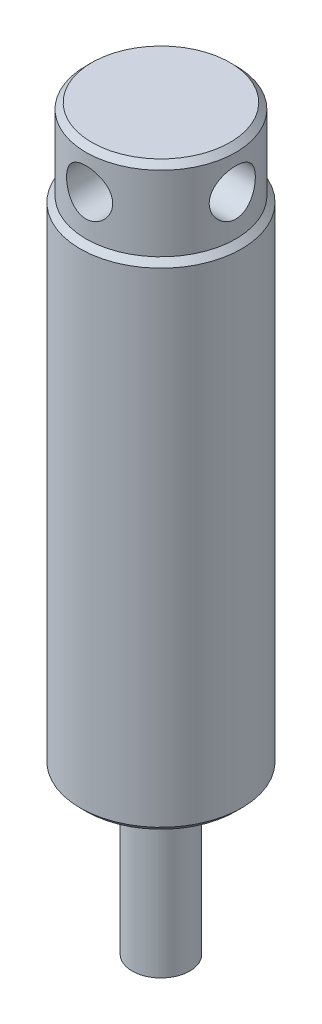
ISO-10303-21;
HEADER;
FILE_DESCRIPTION(('STEP AP214'),'2;1');
FILE_NAME('part.step','',(''),(''),'','','');
FILE_SCHEMA(('AUTOMOTIVE_DESIGN { 1 0 10303 214 1 1 1 1 }'));
ENDSEC;
DATA;
#1=APPLICATION_CONTEXT('core data for automotive mechanical design processes');
#2=APPLICATION_PROTOCOL_DEFINITION('international standard','automotive_design',2000,#1);
#3=PRODUCT_CONTEXT('',#1,'mechanical');
#4=PRODUCT('Part','Part','',(#3));
#5=PRODUCT_RELATED_PRODUCT_CATEGORY('part','',(#4));
#6=PRODUCT_DEFINITION_FORMATION('','',#4);
#7=PRODUCT_DEFINITION_CONTEXT('part definition',#1,'design');
#8=PRODUCT_DEFINITION('design','',#6,#7);
#9=PRODUCT_DEFINITION_SHAPE('','',#8);
#10=(LENGTH_UNIT() NAMED_UNIT(*) SI_UNIT(.MILLI.,.METRE.));
#11=(NAMED_UNIT(*) PLANE_ANGLE_UNIT() SI_UNIT($,.RADIAN.));
#12=(NAMED_UNIT(*) SI_UNIT($,.STERADIAN.) SOLID_ANGLE_UNIT());
#13=UNCERTAINTY_MEASURE_WITH_UNIT(LENGTH_MEASURE(1.E-05),#10,'distance_accuracy_value','');
#14=(GEOMETRIC_REPRESENTATION_CONTEXT(3) GLOBAL_UNCERTAINTY_ASSIGNED_CONTEXT((#13)) GLOBAL_UNIT_ASSIGNED_CONTEXT((#10,
#11,#12)) REPRESENTATION_CONTEXT('',''));
#15=CARTESIAN_POINT('',(0.,0.,0.));
#16=DIRECTION('',(0.,0.,1.));
#17=DIRECTION('',(1.,0.,0.));
#18=AXIS2_PLACEMENT_3D('',#15,#16,#17);
#19=CARTESIAN_POINT('',(0.,60.5,-8.));
#20=DIRECTION('',(0.,0.,1.));
#21=DIRECTION('',(1.,0.,0.));
#22=AXIS2_PLACEMENT_3D('',#19,#20,#21);
#23=CYLINDRICAL_SURFACE('',#22,2.);
#24=CARTESIAN_POINT('',(2.,60.5,6.18465843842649));
#25=CARTESIAN_POINT('',(1.9999990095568,60.3905521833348,6.18465930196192));
#26=CARTESIAN_POINT('',(1.99098535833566,60.2810945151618,6.18759551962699));
#27=CARTESIAN_POINT('',(1.95526805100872,60.0653888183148,6.19897317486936));
#28=CARTESIAN_POINT('',(1.92855917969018,59.9591417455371,6.2074162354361));
#29=CARTESIAN_POINT('',(1.85845185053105,59.753012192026,6.22876273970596));
#30=CARTESIAN_POINT('',(1.8150822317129,59.6531190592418,6.24165847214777));
#31=CARTESIAN_POINT('',(1.71298018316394,59.4620001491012,6.27044669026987));
#32=CARTESIAN_POINT('',(1.65424519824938,59.3707758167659,6.28633967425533));
#33=CARTESIAN_POINT('',(1.52098542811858,59.196546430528,6.31992519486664));
#34=CARTESIAN_POINT('',(1.44603755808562,59.1138725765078,6.33765756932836));
#35=CARTESIAN_POINT('',(1.2833853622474,58.9620462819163,6.37258438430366));
#36=CARTESIAN_POINT('',(1.19567931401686,58.892895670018,6.38977875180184));
#37=CARTESIAN_POINT('',(1.00762969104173,58.7686263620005,6.4221466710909));
#38=CARTESIAN_POINT('',(0.9070517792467,58.7138474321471,6.43726783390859));
#39=CARTESIAN_POINT('',(0.697566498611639,58.6221110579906,6.46332130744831));
#40=CARTESIAN_POINT('',(0.588661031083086,58.5851495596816,6.47425457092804));
#41=CARTESIAN_POINT('',(0.36907878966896,58.5311992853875,6.49041842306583));
#42=CARTESIAN_POINT('',(0.258553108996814,58.513644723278,6.49581021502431));
#43=CARTESIAN_POINT('',(0.0360024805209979,58.4972153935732,6.50085231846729));
#44=CARTESIAN_POINT('',(-0.0760221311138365,58.4983365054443,6.50050389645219));
#45=CARTESIAN_POINT('',(-0.294413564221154,58.5188515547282,6.49421773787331));
#46=CARTESIAN_POINT('',(-0.400844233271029,58.5376324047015,6.48846753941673));
#47=CARTESIAN_POINT('',(-0.6089625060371,58.5919295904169,6.47225351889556));
#48=CARTESIAN_POINT('',(-0.710649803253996,58.6274470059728,6.46178939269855));
#49=CARTESIAN_POINT('',(-0.907825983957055,58.7146112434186,6.43706860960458));
#50=CARTESIAN_POINT('',(-1.00322571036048,58.7664467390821,6.42276789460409));
#51=CARTESIAN_POINT('',(-1.18416561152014,58.8846251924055,6.39188462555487));
#52=CARTESIAN_POINT('',(-1.26970334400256,58.9509717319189,6.37530150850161));
#53=CARTESIAN_POINT('',(-1.43214818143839,59.0994491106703,6.34083036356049));
#54=CARTESIAN_POINT('',(-1.50856604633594,59.1821099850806,6.32291668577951));
#55=CARTESIAN_POINT('',(-1.64659789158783,59.3592439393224,6.28838540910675));
#56=CARTESIAN_POINT('',(-1.70821023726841,59.4537183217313,6.27176795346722));
#57=CARTESIAN_POINT('',(-1.81542815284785,59.6531430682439,6.24158384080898));
#58=CARTESIAN_POINT('',(-1.86085804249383,59.7581934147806,6.22805120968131));
#59=CARTESIAN_POINT('',(-1.93323233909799,59.9749687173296,6.20596978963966));
#60=CARTESIAN_POINT('',(-1.96018314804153,60.0866913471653,6.19741927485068));
#61=CARTESIAN_POINT('',(-1.99390183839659,60.3089645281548,6.18665163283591));
#62=CARTESIAN_POINT('',(-2.00141677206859,60.4193904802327,6.18420022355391));
#63=CARTESIAN_POINT('',(-1.99814331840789,60.6399313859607,6.18525890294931));
#64=CARTESIAN_POINT('',(-1.98735765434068,60.7500463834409,6.18876810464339));
#65=CARTESIAN_POINT('',(-1.94845591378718,60.9636626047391,6.20112183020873));
#66=CARTESIAN_POINT('',(-1.92082922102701,61.0672625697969,6.2098155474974));
#67=CARTESIAN_POINT('',(-1.84960144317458,61.2683468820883,6.23140033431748));
#68=CARTESIAN_POINT('',(-1.80599780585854,61.3658302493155,6.24429207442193));
#69=CARTESIAN_POINT('',(-1.70266083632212,61.5549309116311,6.27326823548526));
#70=CARTESIAN_POINT('',(-1.642510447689,61.6463078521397,6.28943187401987));
#71=CARTESIAN_POINT('',(-1.50827755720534,61.8179435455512,6.32296420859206));
#72=CARTESIAN_POINT('',(-1.43419154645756,61.8981994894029,6.34033320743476));
#73=CARTESIAN_POINT('',(-1.27066455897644,62.0486245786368,6.37515982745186));
#74=CARTESIAN_POINT('',(-1.18072798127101,62.1182619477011,6.39259321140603));
#75=CARTESIAN_POINT('',(-0.990026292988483,62.2414740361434,6.4248880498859));
#76=CARTESIAN_POINT('',(-0.889261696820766,62.2950495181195,6.43974962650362));
#77=CARTESIAN_POINT('',(-0.680404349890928,62.3841011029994,6.46513895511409));
#78=CARTESIAN_POINT('',(-0.572372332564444,62.4197101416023,6.47569842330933));
#79=CARTESIAN_POINT('',(-0.351472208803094,62.4721417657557,6.49143353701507));
#80=CARTESIAN_POINT('',(-0.238605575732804,62.4889700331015,6.49661081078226));
#81=CARTESIAN_POINT('',(-0.0161425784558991,62.502912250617,6.50089371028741));
#82=CARTESIAN_POINT('',(0.0934015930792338,62.5007954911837,6.50023627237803));
#83=CARTESIAN_POINT('',(0.310503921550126,62.4787598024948,6.49348761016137));
#84=CARTESIAN_POINT('',(0.418062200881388,62.4588419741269,6.48739672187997));
#85=CARTESIAN_POINT('',(0.626896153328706,62.4022541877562,6.47053765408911));
#86=CARTESIAN_POINT('',(0.728231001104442,62.3657847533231,6.45982553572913));
#87=CARTESIAN_POINT('',(0.923394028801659,62.2773093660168,6.43482974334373));
#88=CARTESIAN_POINT('',(1.01722093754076,62.2253007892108,6.4205454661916));
#89=CARTESIAN_POINT('',(1.19809140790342,62.1052252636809,6.38931014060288));
#90=CARTESIAN_POINT('',(1.28480651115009,62.036682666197,6.37228632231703));
#91=CARTESIAN_POINT('',(1.44576009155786,61.8863305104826,6.33770998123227));
#92=CARTESIAN_POINT('',(1.51999487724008,61.8045170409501,6.32015730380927));
#93=CARTESIAN_POINT('',(1.65626040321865,61.626823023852,6.28584951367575));
#94=CARTESIAN_POINT('',(1.71782754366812,61.5305776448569,6.26913756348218));
#95=CARTESIAN_POINT('',(1.82384213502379,61.3286092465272,6.23912274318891));
#96=CARTESIAN_POINT('',(1.86829702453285,61.2228903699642,6.22581839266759));
#97=CARTESIAN_POINT('',(1.93528263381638,61.0152118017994,6.20530356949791));
#98=CARTESIAN_POINT('',(1.95948210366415,60.9138336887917,6.19763764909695));
#99=CARTESIAN_POINT('',(1.99183943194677,60.7083062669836,6.18731524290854));
#100=CARTESIAN_POINT('',(2.00000094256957,60.6041575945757,6.18465761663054));
#101=CARTESIAN_POINT('',(2.,60.5,6.18465843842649));
#102=B_SPLINE_CURVE_WITH_KNOTS('',3,(#24,#25,#26,#27,#28,#29,#30,#31,#32,#33,#34,#35,#36,#37,
#38,#39,#40,#41,#42,#43,#44,#45,#46,#47,#48,#49,#50,#51,#52,#53,#54,#55,#56,#57,#58,#59,#60,#61,
#62,#63,#64,#65,#66,#67,#68,#69,#70,#71,#72,#73,#74,#75,#76,#77,#78,#79,#80,#81,#82,#83,#84,#85,
#86,#87,#88,#89,#90,#91,#92,#93,#94,#95,#96,#97,#98,#99,#100,#101),.UNSPECIFIED.,.T.,.F.,(4,2,2,
2,2,2,2,2,2,2,2,2,2,2,2,2,2,2,2,2,2,2,2,2,2,2,2,2,2,2,2,2,2,2,2,2,2,2,4),(0.,0.327958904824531,
0.656014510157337,0.98350480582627,1.31104959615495,1.64848092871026,1.9859578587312,
2.33081172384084,2.6755870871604,3.0100217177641,3.34438256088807,3.66754797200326,
3.99073423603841,4.31780371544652,4.6449540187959,4.98534121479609,5.32576597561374,
5.66978125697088,6.01367729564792,6.34414407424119,6.67456168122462,6.99580726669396,
7.317104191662,7.6473882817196,7.97775564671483,8.3213356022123,8.664899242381,9.00588210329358,
9.34676177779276,9.67386437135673,10.0009467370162,10.3241681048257,10.6474440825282,
10.9814486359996,11.3155518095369,11.6602881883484,12.0048745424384,12.3170524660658,
12.6291592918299),.UNSPECIFIED.);
#103=CARTESIAN_POINT('',(2.,60.5,6.18465843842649));
#104=VERTEX_POINT('',#103);
#105=EDGE_CURVE('E392',#104,#104,#102,.T.);
#106=ORIENTED_EDGE('',*,*,#105,.F.);
#107=EDGE_LOOP('',(#106));
#108=FACE_BOUND('',#107,.T.);
#109=CARTESIAN_POINT('',(0.,60.5,0.));
#110=DIRECTION('',(-0.707106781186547,0.,0.707106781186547));
#111=DIRECTION('',(0.707106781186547,0.,0.707106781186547));
#112=AXIS2_PLACEMENT_3D('',#109,#110,#111);
#113=ELLIPSE('',#112,2.82842712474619,2.);
#114=CARTESIAN_POINT('',(0.,62.5,0.));
#115=VERTEX_POINT('',#114);
#116=CARTESIAN_POINT('',(0.,58.5,0.));
#117=VERTEX_POINT('',#116);
#118=EDGE_CURVE('E364',#115,#117,#113,.F.);
#119=ORIENTED_EDGE('',*,*,#118,.T.);
#120=CARTESIAN_POINT('',(0.,60.5,0.));
#121=DIRECTION('',(0.707106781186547,0.,0.707106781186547));
#122=DIRECTION('',(-0.707106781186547,0.,0.707106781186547));
#123=AXIS2_PLACEMENT_3D('',#120,#121,#122);
#124=ELLIPSE('',#123,2.82842712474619,2.);
#125=EDGE_CURVE('E11',#117,#115,#124,.F.);
#126=ORIENTED_EDGE('',*,*,#125,.T.);
#127=EDGE_LOOP('',(#119,#126));
#128=FACE_BOUND('',#127,.T.);
#129=ADVANCED_FACE('F351',(#108,#128),#23,.F.);
#130=CARTESIAN_POINT('',(0.,14.,0.));
#131=DIRECTION('',(0.,-1.,0.));
#132=DIRECTION('',(0.,0.,-1.));
#133=AXIS2_PLACEMENT_3D('',#130,#131,#132);
#134=CYLINDRICAL_SURFACE('',#133,2.5);
#135=CARTESIAN_POINT('',(0.,14.,0.));
#136=DIRECTION('',(0.,1.,0.));
#137=DIRECTION('',(0.,0.,1.));
#138=AXIS2_PLACEMENT_3D('',#135,#136,#137);
#139=CIRCLE('',#138,2.5);
#140=CARTESIAN_POINT('',(0.,14.,2.5));
#141=VERTEX_POINT('',#140);
#142=EDGE_CURVE('E454',#141,#141,#139,.T.);
#143=ORIENTED_EDGE('',*,*,#142,.F.);
#144=EDGE_LOOP('',(#143));
#145=FACE_BOUND('',#144,.T.);
#146=CARTESIAN_POINT('',(0.,0.,0.));
#147=DIRECTION('',(0.,1.,0.));
#148=DIRECTION('',(0.,0.,1.));
#149=AXIS2_PLACEMENT_3D('',#146,#147,#148);
#150=CIRCLE('',#149,2.5);
#151=CARTESIAN_POINT('',(0.,0.,2.5));
#152=VERTEX_POINT('',#151);
#153=EDGE_CURVE('E451',#152,#152,#150,.T.);
#154=ORIENTED_EDGE('',*,*,#153,.T.);
#155=EDGE_LOOP('',(#154));
#156=FACE_BOUND('',#155,.T.);
#157=ADVANCED_FACE('F353',(#145,#156),#134,.T.);
#158=CARTESIAN_POINT('',(0.,0.,0.));
#159=DIRECTION('',(0.,1.,0.));
#160=DIRECTION('',(0.,0.,1.));
#161=AXIS2_PLACEMENT_3D('',#158,#159,#160);
#162=PLANE('',#161);
#163=ORIENTED_EDGE('',*,*,#153,.F.);
#164=EDGE_LOOP('',(#163));
#165=FACE_BOUND('',#164,.T.);
#166=ADVANCED_FACE('F432',(#165),#162,.F.);
#167=CARTESIAN_POINT('',(0.,14.,0.));
#168=DIRECTION('',(0.,1.,0.));
#169=DIRECTION('',(0.,0.,1.));
#170=AXIS2_PLACEMENT_3D('',#167,#168,#169);
#171=PLANE('',#170);
#172=CARTESIAN_POINT('',(0.,14.,0.));
#173=DIRECTION('',(0.,1.,0.));
#174=DIRECTION('',(0.,0.,1.));
#175=AXIS2_PLACEMENT_3D('',#172,#173,#174);
#176=CIRCLE('',#175,6.5);
#177=CARTESIAN_POINT('',(0.,14.,6.5));
#178=VERTEX_POINT('',#177);
#179=EDGE_CURVE('E379',#178,#178,#176,.F.);
#180=ORIENTED_EDGE('',*,*,#179,.T.);
#181=EDGE_LOOP('',(#180));
#182=FACE_BOUND('',#181,.T.);
#183=ORIENTED_EDGE('',*,*,#142,.T.);
#184=EDGE_LOOP('',(#183));
#185=FACE_BOUND('',#184,.T.);
#186=ADVANCED_FACE('F470',(#182,#185),#171,.F.);
#187=CARTESIAN_POINT('',(0.,57.,0.));
#188=DIRECTION('',(0.,-1.,0.));
#189=DIRECTION('',(0.,0.,-1.));
#190=AXIS2_PLACEMENT_3D('',#187,#188,#189);
#191=CYLINDRICAL_SURFACE('',#190,7.);
#192=CARTESIAN_POINT('',(0.,56.5,0.));
#193=DIRECTION('',(0.,1.,0.));
#194=DIRECTION('',(0.,0.,1.));
#195=AXIS2_PLACEMENT_3D('',#192,#193,#194);
#196=CIRCLE('',#195,7.);
#197=CARTESIAN_POINT('',(0.,56.5,7.));
#198=VERTEX_POINT('',#197);
#199=EDGE_CURVE('E465',#198,#198,#196,.F.);
#200=ORIENTED_EDGE('',*,*,#199,.T.);
#201=EDGE_LOOP('',(#200));
#202=FACE_BOUND('',#201,.T.);
#203=CARTESIAN_POINT('',(0.,14.5,0.));
#204=DIRECTION('',(0.,1.,0.));
#205=DIRECTION('',(0.,0.,1.));
#206=AXIS2_PLACEMENT_3D('',#203,#204,#205);
#207=CIRCLE('',#206,7.);
#208=CARTESIAN_POINT('',(0.,14.5,7.));
#209=VERTEX_POINT('',#208);
#210=EDGE_CURVE('E462',#209,#209,#207,.T.);
#211=ORIENTED_EDGE('',*,*,#210,.T.);
#212=EDGE_LOOP('',(#211));
#213=FACE_BOUND('',#212,.T.);
#214=ADVANCED_FACE('F424',(#202,#213),#191,.T.);
#215=CARTESIAN_POINT('',(0.,64.,0.));
#216=DIRECTION('',(0.,-1.,0.));
#217=DIRECTION('',(0.,0.,-1.));
#218=AXIS2_PLACEMENT_3D('',#215,#216,#217);
#219=CYLINDRICAL_SURFACE('',#218,6.5);
#220=CARTESIAN_POINT('',(-6.18465843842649,60.5,-2.));
#221=CARTESIAN_POINT('',(-6.18465930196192,60.6094478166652,-1.9999990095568));
#222=CARTESIAN_POINT('',(-6.18759551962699,60.7189054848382,-1.99098535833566));
#223=CARTESIAN_POINT('',(-6.19897317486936,60.9346111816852,-1.95526805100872));
#224=CARTESIAN_POINT('',(-6.2074162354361,61.0408582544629,-1.92855917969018));
#225=CARTESIAN_POINT('',(-6.22876273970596,61.246987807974,-1.85845185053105));
#226=CARTESIAN_POINT('',(-6.24165847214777,61.3468809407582,-1.8150822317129));
#227=CARTESIAN_POINT('',(-6.27044669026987,61.5379998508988,-1.71298018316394));
#228=CARTESIAN_POINT('',(-6.28633967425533,61.6292241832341,-1.65424519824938));
#229=CARTESIAN_POINT('',(-6.31992519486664,61.803453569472,-1.52098542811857));
#230=CARTESIAN_POINT('',(-6.33765756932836,61.8861274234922,-1.44603755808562));
#231=CARTESIAN_POINT('',(-6.37258438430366,62.0379537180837,-1.28338536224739));
#232=CARTESIAN_POINT('',(-6.38977875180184,62.107104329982,-1.19567931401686));
#233=CARTESIAN_POINT('',(-6.4221466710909,62.2313736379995,-1.00762969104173));
#234=CARTESIAN_POINT('',(-6.43726783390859,62.2861525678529,-0.907051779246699));
#235=CARTESIAN_POINT('',(-6.46332130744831,62.3778889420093,-0.697566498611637));
#236=CARTESIAN_POINT('',(-6.47425457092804,62.4148504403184,-0.588661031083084));
#237=CARTESIAN_POINT('',(-6.49041842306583,62.4688007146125,-0.369078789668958));
#238=CARTESIAN_POINT('',(-6.49581021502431,62.486355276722,-0.258553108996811));
#239=CARTESIAN_POINT('',(-6.50085231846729,62.5027846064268,-0.0360024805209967));
#240=CARTESIAN_POINT('',(-6.50050389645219,62.5016634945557,0.076022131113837));
#241=CARTESIAN_POINT('',(-6.49421773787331,62.4811484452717,0.294413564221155));
#242=CARTESIAN_POINT('',(-6.48846753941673,62.4623675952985,0.40084423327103));
#243=CARTESIAN_POINT('',(-6.47225351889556,62.4080704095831,0.608962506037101));
#244=CARTESIAN_POINT('',(-6.46178939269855,62.3725529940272,0.710649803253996));
#245=CARTESIAN_POINT('',(-6.43706860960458,62.2853887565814,0.907825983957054));
#246=CARTESIAN_POINT('',(-6.42276789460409,62.2335532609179,1.00322571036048));
#247=CARTESIAN_POINT('',(-6.39188462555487,62.1153748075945,1.18416561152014));
#248=CARTESIAN_POINT('',(-6.37530150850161,62.0490282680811,1.26970334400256));
#249=CARTESIAN_POINT('',(-6.34083036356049,61.9005508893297,1.43214818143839));
#250=CARTESIAN_POINT('',(-6.32291668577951,61.8178900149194,1.50856604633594));
#251=CARTESIAN_POINT('',(-6.28838540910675,61.6407560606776,1.64659789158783));
#252=CARTESIAN_POINT('',(-6.27176795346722,61.5462816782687,1.70821023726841));
#253=CARTESIAN_POINT('',(-6.24158384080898,61.3468569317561,1.81542815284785));
#254=CARTESIAN_POINT('',(-6.22805120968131,61.2418065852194,1.86085804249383));
#255=CARTESIAN_POINT('',(-6.20596978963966,61.0250312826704,1.93323233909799));
#256=CARTESIAN_POINT('',(-6.19741927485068,60.9133086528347,1.96018314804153));
#257=CARTESIAN_POINT('',(-6.18665163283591,60.6910354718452,1.99390183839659));
#258=CARTESIAN_POINT('',(-6.18420022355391,60.5806095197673,2.00141677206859));
#259=CARTESIAN_POINT('',(-6.18525890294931,60.3600686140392,1.99814331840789));
#260=CARTESIAN_POINT('',(-6.18876810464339,60.2499536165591,1.98735765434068));
#261=CARTESIAN_POINT('',(-6.20112183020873,60.0363373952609,1.94845591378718));
#262=CARTESIAN_POINT('',(-6.20981554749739,59.9327374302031,1.92082922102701));
#263=CARTESIAN_POINT('',(-6.23140033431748,59.7316531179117,1.84960144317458));
#264=CARTESIAN_POINT('',(-6.24429207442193,59.6341697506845,1.80599780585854));
#265=CARTESIAN_POINT('',(-6.27326823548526,59.4450690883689,1.70266083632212));
#266=CARTESIAN_POINT('',(-6.28943187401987,59.3536921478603,1.642510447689));
#267=CARTESIAN_POINT('',(-6.32296420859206,59.1820564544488,1.50827755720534));
#268=CARTESIAN_POINT('',(-6.34033320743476,59.1018005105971,1.43419154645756));
#269=CARTESIAN_POINT('',(-6.37515982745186,58.9513754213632,1.27066455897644));
#270=CARTESIAN_POINT('',(-6.39259321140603,58.8817380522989,1.18072798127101));
#271=CARTESIAN_POINT('',(-6.4248880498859,58.7585259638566,0.990026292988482));
#272=CARTESIAN_POINT('',(-6.43974962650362,58.7049504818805,0.889261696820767));
#273=CARTESIAN_POINT('',(-6.46513895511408,58.6158988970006,0.680404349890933));
#274=CARTESIAN_POINT('',(-6.47569842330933,58.5802898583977,0.572372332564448));
#275=CARTESIAN_POINT('',(-6.49143353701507,58.5278582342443,0.351472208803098));
#276=CARTESIAN_POINT('',(-6.49661081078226,58.5110299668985,0.238605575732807));
#277=CARTESIAN_POINT('',(-6.50089371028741,58.497087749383,0.0161425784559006));
#278=CARTESIAN_POINT('',(-6.50023627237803,58.4992045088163,-0.0934015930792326));
#279=CARTESIAN_POINT('',(-6.49348761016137,58.5212401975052,-0.310503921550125));
#280=CARTESIAN_POINT('',(-6.48739672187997,58.5411580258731,-0.418062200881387));
#281=CARTESIAN_POINT('',(-6.47053765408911,58.5977458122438,-0.626896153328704));
#282=CARTESIAN_POINT('',(-6.45982553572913,58.6342152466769,-0.72823100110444));
#283=CARTESIAN_POINT('',(-6.43482974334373,58.7226906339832,-0.923394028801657));
#284=CARTESIAN_POINT('',(-6.4205454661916,58.7746992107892,-1.01722093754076));
#285=CARTESIAN_POINT('',(-6.38931014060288,58.8947747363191,-1.19809140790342));
#286=CARTESIAN_POINT('',(-6.37228632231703,58.963317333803,-1.28480651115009));
#287=CARTESIAN_POINT('',(-6.33770998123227,59.1136694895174,-1.44576009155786));
#288=CARTESIAN_POINT('',(-6.32015730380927,59.1954829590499,-1.51999487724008));
#289=CARTESIAN_POINT('',(-6.28584951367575,59.3731769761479,-1.65626040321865));
#290=CARTESIAN_POINT('',(-6.26913756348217,59.4694223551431,-1.71782754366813));
#291=CARTESIAN_POINT('',(-6.23912274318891,59.6713907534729,-1.8238421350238));
#292=CARTESIAN_POINT('',(-6.22581839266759,59.7771096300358,-1.86829702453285));
#293=CARTESIAN_POINT('',(-6.20530356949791,59.9847881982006,-1.93528263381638));
#294=CARTESIAN_POINT('',(-6.19763764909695,60.0861663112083,-1.95948210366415));
#295=CARTESIAN_POINT('',(-6.18731524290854,60.2916937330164,-1.99183943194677));
#296=CARTESIAN_POINT('',(-6.18465761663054,60.3958424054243,-2.00000094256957));
#297=CARTESIAN_POINT('',(-6.18465843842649,60.5,-2.));
#298=B_SPLINE_CURVE_WITH_KNOTS('',3,(#220,#221,#222,#223,#224,#225,#226,#227,#228,#229,#230,
#231,#232,#233,#234,#235,#236,#237,#238,#239,#240,#241,#242,#243,#244,#245,#246,#247,#248,#249,
#250,#251,#252,#253,#254,#255,#256,#257,#258,#259,#260,#261,#262,#263,#264,#265,#266,#267,#268,
#269,#270,#271,#272,#273,#274,#275,#276,#277,#278,#279,#280,#281,#282,#283,#284,#285,#286,#287,
#288,#289,#290,#291,#292,#293,#294,#295,#296,#297),.UNSPECIFIED.,.T.,.F.,(4,2,2,2,2,2,2,2,2,2,2,
2,2,2,2,2,2,2,2,2,2,2,2,2,2,2,2,2,2,2,2,2,2,2,2,2,2,2,4),(0.,0.327958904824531,
0.656014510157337,0.98350480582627,1.31104959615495,1.64848092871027,1.9859578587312,
2.33081172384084,2.6755870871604,3.0100217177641,3.34438256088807,3.66754797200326,
3.99073423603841,4.31780371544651,4.6449540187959,4.98534121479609,5.32576597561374,
5.66978125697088,6.01367729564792,6.34414407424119,6.67456168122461,6.99580726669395,
7.31710419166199,7.6473882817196,7.97775564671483,8.3213356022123,8.66489924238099,
9.00588210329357,9.34676177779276,9.67386437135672,10.0009467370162,10.3241681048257,
10.6474440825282,10.9814486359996,11.3155518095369,11.6602881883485,12.0048745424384,
12.3170524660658,12.6291592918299),.UNSPECIFIED.);
#299=CARTESIAN_POINT('',(-6.18465843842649,60.5,-2.));
#300=VERTEX_POINT('',#299);
#301=EDGE_CURVE('E437',#300,#300,#298,.T.);
#302=ORIENTED_EDGE('',*,*,#301,.T.);
#303=EDGE_LOOP('',(#302));
#304=FACE_BOUND('',#303,.T.);
#305=CARTESIAN_POINT('',(6.18465843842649,60.5,-2.));
#306=CARTESIAN_POINT('',(6.18465930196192,60.3905521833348,-1.9999990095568));
#307=CARTESIAN_POINT('',(6.18759551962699,60.2810945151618,-1.99098535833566));
#308=CARTESIAN_POINT('',(6.19897317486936,60.0653888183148,-1.95526805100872));
#309=CARTESIAN_POINT('',(6.2074162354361,59.9591417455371,-1.92855917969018));
#310=CARTESIAN_POINT('',(6.22876273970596,59.753012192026,-1.85845185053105));
#311=CARTESIAN_POINT('',(6.24165847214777,59.6531190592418,-1.8150822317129));
#312=CARTESIAN_POINT('',(6.27044669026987,59.4620001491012,-1.71298018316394));
#313=CARTESIAN_POINT('',(6.28633967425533,59.3707758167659,-1.65424519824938));
#314=CARTESIAN_POINT('',(6.31992519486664,59.196546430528,-1.52098542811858));
#315=CARTESIAN_POINT('',(6.33765756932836,59.1138725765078,-1.44603755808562));
#316=CARTESIAN_POINT('',(6.37258438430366,58.9620462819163,-1.2833853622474));
#317=CARTESIAN_POINT('',(6.38977875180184,58.892895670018,-1.19567931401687));
#318=CARTESIAN_POINT('',(6.4221466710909,58.7686263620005,-1.00762969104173));
#319=CARTESIAN_POINT('',(6.43726783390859,58.7138474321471,-0.9070517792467));
#320=CARTESIAN_POINT('',(6.46332130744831,58.6221110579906,-0.697566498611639));
#321=CARTESIAN_POINT('',(6.47425457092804,58.5851495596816,-0.588661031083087));
#322=CARTESIAN_POINT('',(6.49041842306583,58.5311992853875,-0.369078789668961));
#323=CARTESIAN_POINT('',(6.49581021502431,58.513644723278,-0.258553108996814));
#324=CARTESIAN_POINT('',(6.50085231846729,58.4972153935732,-0.0360024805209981));
#325=CARTESIAN_POINT('',(6.50050389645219,58.4983365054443,0.0760221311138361));
#326=CARTESIAN_POINT('',(6.49421773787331,58.5188515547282,0.294413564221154));
#327=CARTESIAN_POINT('',(6.48846753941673,58.5376324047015,0.40084423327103));
#328=CARTESIAN_POINT('',(6.47225351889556,58.5919295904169,0.6089625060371));
#329=CARTESIAN_POINT('',(6.46178939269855,58.6274470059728,0.710649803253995));
#330=CARTESIAN_POINT('',(6.43706860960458,58.7146112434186,0.907825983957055));
#331=CARTESIAN_POINT('',(6.42276789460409,58.7664467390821,1.00322571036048));
#332=CARTESIAN_POINT('',(6.39188462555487,58.8846251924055,1.18416561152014));
#333=CARTESIAN_POINT('',(6.37530150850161,58.9509717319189,1.26970334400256));
#334=CARTESIAN_POINT('',(6.34083036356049,59.0994491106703,1.43214818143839));
#335=CARTESIAN_POINT('',(6.32291668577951,59.1821099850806,1.50856604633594));
#336=CARTESIAN_POINT('',(6.28838540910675,59.3592439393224,1.64659789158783));
#337=CARTESIAN_POINT('',(6.27176795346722,59.4537183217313,1.70821023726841));
#338=CARTESIAN_POINT('',(6.24158384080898,59.6531430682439,1.81542815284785));
#339=CARTESIAN_POINT('',(6.22805120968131,59.7581934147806,1.86085804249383));
#340=CARTESIAN_POINT('',(6.20596978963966,59.9749687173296,1.93323233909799));
#341=CARTESIAN_POINT('',(6.19741927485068,60.0866913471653,1.96018314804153));
#342=CARTESIAN_POINT('',(6.18665163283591,60.3089645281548,1.99390183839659));
#343=CARTESIAN_POINT('',(6.18420022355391,60.4193904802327,2.00141677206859));
#344=CARTESIAN_POINT('',(6.18525890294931,60.6399313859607,1.99814331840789));
#345=CARTESIAN_POINT('',(6.18876810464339,60.7500463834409,1.98735765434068));
#346=CARTESIAN_POINT('',(6.20112183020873,60.9636626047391,1.94845591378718));
#347=CARTESIAN_POINT('',(6.20981554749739,61.0672625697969,1.92082922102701));
#348=CARTESIAN_POINT('',(6.23140033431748,61.2683468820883,1.84960144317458));
#349=CARTESIAN_POINT('',(6.24429207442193,61.3658302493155,1.80599780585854));
#350=CARTESIAN_POINT('',(6.27326823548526,61.5549309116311,1.70266083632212));
#351=CARTESIAN_POINT('',(6.28943187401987,61.6463078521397,1.642510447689));
#352=CARTESIAN_POINT('',(6.32296420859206,61.8179435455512,1.50827755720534));
#353=CARTESIAN_POINT('',(6.34033320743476,61.8981994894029,1.43419154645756));
#354=CARTESIAN_POINT('',(6.37515982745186,62.0486245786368,1.27066455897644));
#355=CARTESIAN_POINT('',(6.39259321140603,62.1182619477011,1.18072798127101));
#356=CARTESIAN_POINT('',(6.4248880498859,62.2414740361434,0.990026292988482));
#357=CARTESIAN_POINT('',(6.43974962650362,62.2950495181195,0.889261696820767));
#358=CARTESIAN_POINT('',(6.46513895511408,62.3841011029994,0.680404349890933));
#359=CARTESIAN_POINT('',(6.47569842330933,62.4197101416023,0.572372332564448));
#360=CARTESIAN_POINT('',(6.49143353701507,62.4721417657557,0.351472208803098));
#361=CARTESIAN_POINT('',(6.49661081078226,62.4889700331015,0.238605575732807));
#362=CARTESIAN_POINT('',(6.50089371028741,62.502912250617,0.0161425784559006));
#363=CARTESIAN_POINT('',(6.50023627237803,62.5007954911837,-0.0934015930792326));
#364=CARTESIAN_POINT('',(6.49348761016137,62.4787598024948,-0.310503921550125));
#365=CARTESIAN_POINT('',(6.48739672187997,62.4588419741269,-0.418062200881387));
#366=CARTESIAN_POINT('',(6.47053765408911,62.4022541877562,-0.626896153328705));
#367=CARTESIAN_POINT('',(6.45982553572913,62.3657847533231,-0.728231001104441));
#368=CARTESIAN_POINT('',(6.43482974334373,62.2773093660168,-0.923394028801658));
#369=CARTESIAN_POINT('',(6.4205454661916,62.2253007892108,-1.01722093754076));
#370=CARTESIAN_POINT('',(6.38931014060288,62.1052252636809,-1.19809140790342));
#371=CARTESIAN_POINT('',(6.37228632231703,62.036682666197,-1.28480651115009));
#372=CARTESIAN_POINT('',(6.33770998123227,61.8863305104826,-1.44576009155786));
#373=CARTESIAN_POINT('',(6.32015730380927,61.8045170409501,-1.51999487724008));
#374=CARTESIAN_POINT('',(6.28584951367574,61.626823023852,-1.65626040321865));
#375=CARTESIAN_POINT('',(6.26913756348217,61.5305776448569,-1.71782754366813));
#376=CARTESIAN_POINT('',(6.23912274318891,61.3286092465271,-1.8238421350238));
#377=CARTESIAN_POINT('',(6.22581839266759,61.2228903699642,-1.86829702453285));
#378=CARTESIAN_POINT('',(6.20530356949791,61.0152118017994,-1.93528263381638));
#379=CARTESIAN_POINT('',(6.19763764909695,60.9138336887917,-1.95948210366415));
#380=CARTESIAN_POINT('',(6.18731524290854,60.7083062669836,-1.99183943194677));
#381=CARTESIAN_POINT('',(6.18465761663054,60.6041575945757,-2.00000094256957));
#382=CARTESIAN_POINT('',(6.18465843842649,60.5,-2.));
#383=B_SPLINE_CURVE_WITH_KNOTS('',3,(#305,#306,#307,#308,#309,#310,#311,#312,#313,#314,#315,
#316,#317,#318,#319,#320,#321,#322,#323,#324,#325,#326,#327,#328,#329,#330,#331,#332,#333,#334,
#335,#336,#337,#338,#339,#340,#341,#342,#343,#344,#345,#346,#347,#348,#349,#350,#351,#352,#353,
#354,#355,#356,#357,#358,#359,#360,#361,#362,#363,#364,#365,#366,#367,#368,#369,#370,#371,#372,
#373,#374,#375,#376,#377,#378,#379,#380,#381,#382),.UNSPECIFIED.,.T.,.F.,(4,2,2,2,2,2,2,2,2,2,2,
2,2,2,2,2,2,2,2,2,2,2,2,2,2,2,2,2,2,2,2,2,2,2,2,2,2,2,4),(0.,0.327958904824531,
0.656014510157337,0.98350480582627,1.31104959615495,1.64848092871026,1.9859578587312,
2.33081172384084,2.6755870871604,3.0100217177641,3.34438256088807,3.66754797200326,
3.99073423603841,4.31780371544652,4.6449540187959,4.98534121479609,5.32576597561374,
5.66978125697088,6.01367729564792,6.34414407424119,6.67456168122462,6.99580726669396,
7.317104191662,7.6473882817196,7.97775564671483,8.3213356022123,8.664899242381,9.00588210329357,
9.34676177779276,9.67386437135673,10.0009467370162,10.3241681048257,10.6474440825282,
10.9814486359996,11.3155518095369,11.6602881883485,12.0048745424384,12.3170524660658,
12.6291592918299),.UNSPECIFIED.);
#384=CARTESIAN_POINT('',(6.18465843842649,60.5,-2.));
#385=VERTEX_POINT('',#384);
#386=EDGE_CURVE('E439',#385,#385,#383,.T.);
#387=ORIENTED_EDGE('',*,*,#386,.T.);
#388=EDGE_LOOP('',(#387));
#389=FACE_BOUND('',#388,.T.);
#390=CARTESIAN_POINT('',(0.,62.5,-6.5));
#391=CARTESIAN_POINT('',(-0.10958647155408,62.499999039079,-6.49999929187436));
#392=CARTESIAN_POINT('',(-0.219182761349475,62.4909633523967,-6.49720235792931));
#393=CARTESIAN_POINT('',(-0.435175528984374,62.4551505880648,-6.48631855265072));
#394=CARTESIAN_POINT('',(-0.541571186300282,62.4283690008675,-6.47823033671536));
#395=CARTESIAN_POINT('',(-0.748016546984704,62.3580492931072,-6.45764858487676));
#396=CARTESIAN_POINT('',(-0.848075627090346,62.3145366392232,-6.44516174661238));
#397=CARTESIAN_POINT('',(-1.03947745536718,62.2120967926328,-6.41707535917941));
#398=CARTESIAN_POINT('',(-1.13081890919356,62.1531673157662,-6.40147534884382));
#399=CARTESIAN_POINT('',(-1.30493699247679,62.0197023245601,-6.36829752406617));
#400=CARTESIAN_POINT('',(-1.38741488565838,61.9447875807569,-6.35067760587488));
#401=CARTESIAN_POINT('',(-1.53885708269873,61.782286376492,-6.31569252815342));
#402=CARTESIAN_POINT('',(-1.60781896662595,61.6946976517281,-6.29832741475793));
#403=CARTESIAN_POINT('',(-1.73187276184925,61.5067713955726,-6.2653687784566));
#404=CARTESIAN_POINT('',(-1.78659481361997,61.4061797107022,-6.24982736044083));
#405=CARTESIAN_POINT('',(-1.8782224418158,61.1966660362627,-6.22290748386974));
#406=CARTESIAN_POINT('',(-1.91513254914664,61.0877461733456,-6.21152796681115));
#407=CARTESIAN_POINT('',(-1.96900160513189,60.8680326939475,-6.19466009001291));
#408=CARTESIAN_POINT('',(-1.9865133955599,60.7573874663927,-6.18900890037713));
#409=CARTESIAN_POINT('',(-2.00281555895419,60.5345962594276,-6.1837537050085));
#410=CARTESIAN_POINT('',(-2.00161073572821,60.4224506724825,-6.18414814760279));
#411=CARTESIAN_POINT('',(-1.98094698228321,60.2043849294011,-6.19079569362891));
#412=CARTESIAN_POINT('',(-1.96218684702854,60.0983905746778,-6.19682450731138));
#413=CARTESIAN_POINT('',(-1.90807645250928,59.8911333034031,-6.21369772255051));
#414=CARTESIAN_POINT('',(-1.8727244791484,59.7898708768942,-6.22454262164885));
#415=CARTESIAN_POINT('',(-1.78593221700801,59.593269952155,-6.2500007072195));
#416=CARTESIAN_POINT('',(-1.73426970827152,59.4980365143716,-6.2646654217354));
#417=CARTESIAN_POINT('',(-1.61647725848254,59.3173594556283,-6.29608673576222));
#418=CARTESIAN_POINT('',(-1.55034365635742,59.2319183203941,-6.31284386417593));
#419=CARTESIAN_POINT('',(-1.40204114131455,59.0692956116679,-6.34746551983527));
#420=CARTESIAN_POINT('',(-1.31929416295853,58.9926437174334,-6.36534631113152));
#421=CARTESIAN_POINT('',(-1.14189770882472,58.8541777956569,-6.39954830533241));
#422=CARTESIAN_POINT('',(-1.04724740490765,58.7923648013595,-6.4158693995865));
#423=CARTESIAN_POINT('',(-0.847732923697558,58.6849870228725,-6.44527556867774));
#424=CARTESIAN_POINT('',(-0.742798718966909,58.6395451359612,-6.45833594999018));
#425=CARTESIAN_POINT('',(-0.526280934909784,58.5671137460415,-6.47957102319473));
#426=CARTESIAN_POINT('',(-0.414699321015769,58.5401188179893,-6.48774715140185));
#427=CARTESIAN_POINT('',(-0.192552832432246,58.5062419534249,-6.49806290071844));
#428=CARTESIAN_POINT('',(-0.0821071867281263,58.4986426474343,-6.50041772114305));
#429=CARTESIAN_POINT('',(0.138491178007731,58.501754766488,-6.49946000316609));
#430=CARTESIAN_POINT('',(0.248643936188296,58.5124636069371,-6.49614826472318));
#431=CARTESIAN_POINT('',(0.462785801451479,58.5513104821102,-6.48437074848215));
#432=CARTESIAN_POINT('',(0.566859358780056,58.5790246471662,-6.47603039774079));
#433=CARTESIAN_POINT('',(0.768852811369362,58.6505810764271,-6.45516726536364));
#434=CARTESIAN_POINT('',(0.866771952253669,58.6944253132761,-6.44264397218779));
#435=CARTESIAN_POINT('',(1.05627961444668,58.7981711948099,-6.41433382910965));
#436=CARTESIAN_POINT('',(1.14766081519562,58.8584316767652,-6.39847611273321));
#437=CARTESIAN_POINT('',(1.31925606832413,58.9928668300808,-6.36531333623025));
#438=CARTESIAN_POINT('',(1.39946717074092,59.067045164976,-6.34800789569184));
#439=CARTESIAN_POINT('',(1.54963528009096,59.230583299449,-6.31306645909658));
#440=CARTESIAN_POINT('',(1.61908131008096,59.3204160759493,-6.29544322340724));
#441=CARTESIAN_POINT('',(1.74195487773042,59.5108433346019,-6.2625596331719));
#442=CARTESIAN_POINT('',(1.79538273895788,59.6114375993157,-6.24729923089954));
#443=CARTESIAN_POINT('',(1.88435707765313,59.820278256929,-6.22104126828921));
#444=CARTESIAN_POINT('',(1.9199786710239,59.928490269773,-6.21002584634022));
#445=CARTESIAN_POINT('',(1.97237526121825,60.1497826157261,-6.19358575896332));
#446=CARTESIAN_POINT('',(1.98915714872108,60.262861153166,-6.18815904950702));
#447=CARTESIAN_POINT('',(2.00291323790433,60.4853480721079,-6.18371932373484));
#448=CARTESIAN_POINT('',(2.00072360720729,60.5947000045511,-6.18443554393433));
#449=CARTESIAN_POINT('',(1.97860856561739,60.8113978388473,-6.19154584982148));
#450=CARTESIAN_POINT('',(1.95868393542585,60.9187438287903,-6.19793968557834));
#451=CARTESIAN_POINT('',(1.90221657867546,61.1269374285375,-6.21549850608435));
#452=CARTESIAN_POINT('',(1.86590616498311,61.2278541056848,-6.22659666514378));
#453=CARTESIAN_POINT('',(1.77788001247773,61.4222435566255,-6.25229841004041));
#454=CARTESIAN_POINT('',(1.72616121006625,61.5157148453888,-6.26690269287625));
#455=CARTESIAN_POINT('',(1.60648172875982,61.6964125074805,-6.29866516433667));
#456=CARTESIAN_POINT('',(1.5379775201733,61.7832654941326,-6.31589943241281));
#457=CARTESIAN_POINT('',(1.38763671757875,61.9445140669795,-6.35062263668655));
#458=CARTESIAN_POINT('',(1.30579660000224,62.0189063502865,-6.36811163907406));
#459=CARTESIAN_POINT('',(1.12802317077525,62.1554491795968,-6.40203042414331));
#460=CARTESIAN_POINT('',(1.03172886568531,62.2171435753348,-6.41840990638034));
#461=CARTESIAN_POINT('',(0.829631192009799,62.3233844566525,-6.44764383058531));
#462=CARTESIAN_POINT('',(0.723831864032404,62.367938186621,-6.46049976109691));
#463=CARTESIAN_POINT('',(0.515929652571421,62.4351007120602,-6.48025348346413));
#464=CARTESIAN_POINT('',(0.414403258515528,62.4593694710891,-6.48759534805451));
#465=CARTESIAN_POINT('',(0.208587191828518,62.4918180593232,-6.4974684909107));
#466=CARTESIAN_POINT('',(0.104298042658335,62.5000009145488,-6.50000067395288));
#467=CARTESIAN_POINT('',(0.,62.5,-6.5));
#468=B_SPLINE_CURVE_WITH_KNOTS('',3,(#390,#391,#392,#393,#394,#395,#396,#397,#398,#399,#400,
#401,#402,#403,#404,#405,#406,#407,#408,#409,#410,#411,#412,#413,#414,#415,#416,#417,#418,#419,
#420,#421,#422,#423,#424,#425,#426,#427,#428,#429,#430,#431,#432,#433,#434,#435,#436,#437,#438,
#439,#440,#441,#442,#443,#444,#445,#446,#447,#448,#449,#450,#451,#452,#453,#454,#455,#456,#457,
#458,#459,#460,#461,#462,#463,#464,#465,#466,#467),.UNSPECIFIED.,.T.,.F.,(4,2,2,2,2,2,2,2,2,2,2,
2,2,2,2,2,2,2,2,2,2,2,2,2,2,2,2,2,2,2,2,2,2,2,2,2,2,2,4),(0.,0.328376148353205,
0.656835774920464,0.98479741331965,1.31280767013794,1.64969601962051,1.98664463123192,
2.33162619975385,2.67651996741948,3.01130912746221,3.34601236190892,3.66793485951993,
3.98989062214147,4.31643724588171,4.64306657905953,4.98408507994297,5.32512731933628,
5.66867887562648,6.01212935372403,6.34267966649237,6.67318331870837,6.99576592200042,
7.31838798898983,7.64872325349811,7.97914559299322,8.32223487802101,8.66531723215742,
9.00693981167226,9.34843740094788,9.6749627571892,10.0014737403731,10.3234943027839,
10.6455789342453,10.9799294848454,11.3143685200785,11.6592775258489,12.0040405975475,
12.3166287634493,12.6291581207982),.UNSPECIFIED.);
#469=CARTESIAN_POINT('',(0.,62.5,-6.5));
#470=VERTEX_POINT('',#469);
#471=EDGE_CURVE('E384',#470,#470,#468,.T.);
#472=ORIENTED_EDGE('',*,*,#471,.T.);
#473=EDGE_LOOP('',(#472));
#474=FACE_BOUND('',#473,.T.);
#475=ORIENTED_EDGE('',*,*,#105,.T.);
#476=EDGE_LOOP('',(#475));
#477=FACE_BOUND('',#476,.T.);
#478=CARTESIAN_POINT('',(0.,63.5,0.));
#479=DIRECTION('',(0.,1.,0.));
#480=DIRECTION('',(0.,0.,1.));
#481=AXIS2_PLACEMENT_3D('',#478,#479,#480);
#482=CIRCLE('',#481,6.5);
#483=CARTESIAN_POINT('',(0.,63.5,6.5));
#484=VERTEX_POINT('',#483);
#485=EDGE_CURVE('E459',#484,#484,#482,.F.);
#486=ORIENTED_EDGE('',*,*,#485,.T.);
#487=EDGE_LOOP('',(#486));
#488=FACE_BOUND('',#487,.T.);
#489=CARTESIAN_POINT('',(0.,57.,0.));
#490=DIRECTION('',(0.,1.,0.));
#491=DIRECTION('',(0.,0.,1.));
#492=AXIS2_PLACEMENT_3D('',#489,#490,#491);
#493=CIRCLE('',#492,6.5);
#494=CARTESIAN_POINT('',(0.,57.,6.5));
#495=VERTEX_POINT('',#494);
#496=EDGE_CURVE('E391',#495,#495,#493,.T.);
#497=ORIENTED_EDGE('',*,*,#496,.T.);
#498=EDGE_LOOP('',(#497));
#499=FACE_BOUND('',#498,.T.);
#500=ADVANCED_FACE('F396',(#304,#389,#474,#477,#488,#499),#219,.T.);
#501=CARTESIAN_POINT('',(0.,64.,0.));
#502=DIRECTION('',(0.,1.,0.));
#503=DIRECTION('',(0.,0.,1.));
#504=AXIS2_PLACEMENT_3D('',#501,#502,#503);
#505=PLANE('',#504);
#506=CARTESIAN_POINT('',(0.,64.,0.));
#507=DIRECTION('',(0.,1.,0.));
#508=DIRECTION('',(0.,0.,1.));
#509=AXIS2_PLACEMENT_3D('',#506,#507,#508);
#510=CIRCLE('',#509,6.);
#511=CARTESIAN_POINT('',(0.,64.,6.));
#512=VERTEX_POINT('',#511);
#513=EDGE_CURVE('E457',#512,#512,#510,.T.);
#514=ORIENTED_EDGE('',*,*,#513,.T.);
#515=EDGE_LOOP('',(#514));
#516=FACE_BOUND('',#515,.T.);
#517=ADVANCED_FACE('F416',(#516),#505,.T.);
#518=CARTESIAN_POINT('',(0.,64.,0.));
#519=DIRECTION('',(0.,-1.,0.));
#520=DIRECTION('',(0.,0.,-1.));
#521=AXIS2_PLACEMENT_3D('',#518,#519,#520);
#522=CONICAL_SURFACE('',#521,6.,0.785398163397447);
#523=ORIENTED_EDGE('',*,*,#485,.F.);
#524=EDGE_LOOP('',(#523));
#525=FACE_BOUND('',#524,.T.);
#526=ORIENTED_EDGE('',*,*,#513,.F.);
#527=EDGE_LOOP('',(#526));
#528=FACE_BOUND('',#527,.T.);
#529=ADVANCED_FACE('F413',(#525,#528),#522,.T.);
#530=CARTESIAN_POINT('',(0.,57.,0.));
#531=DIRECTION('',(0.,-1.,0.));
#532=DIRECTION('',(0.,0.,-1.));
#533=AXIS2_PLACEMENT_3D('',#530,#531,#532);
#534=CONICAL_SURFACE('',#533,6.5,0.785398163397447);
#535=ORIENTED_EDGE('',*,*,#199,.F.);
#536=EDGE_LOOP('',(#535));
#537=FACE_BOUND('',#536,.T.);
#538=ORIENTED_EDGE('',*,*,#496,.F.);
#539=EDGE_LOOP('',(#538));
#540=FACE_BOUND('',#539,.T.);
#541=ADVANCED_FACE('F409',(#537,#540),#534,.T.);
#542=CARTESIAN_POINT('',(0.,14.5,0.));
#543=DIRECTION('',(0.,1.,0.));
#544=DIRECTION('',(0.,0.,1.));
#545=AXIS2_PLACEMENT_3D('',#542,#543,#544);
#546=CONICAL_SURFACE('',#545,7.,0.78539816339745);
#547=ORIENTED_EDGE('',*,*,#179,.F.);
#548=EDGE_LOOP('',(#547));
#549=FACE_BOUND('',#548,.T.);
#550=ORIENTED_EDGE('',*,*,#210,.F.);
#551=EDGE_LOOP('',(#550));
#552=FACE_BOUND('',#551,.T.);
#553=ADVANCED_FACE('F404',(#549,#552),#546,.T.);
#554=CARTESIAN_POINT('',(0.,60.5,0.));
#555=DIRECTION('',(-0.707106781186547,0.,0.707106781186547));
#556=DIRECTION('',(0.707106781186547,0.,0.707106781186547));
#557=AXIS2_PLACEMENT_3D('',#554,#555,#556);
#558=ELLIPSE('',#557,2.82842712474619,2.);
#559=EDGE_CURVE('E370',#115,#117,#558,.T.);
#560=ORIENTED_EDGE('',*,*,#559,.T.);
#561=CARTESIAN_POINT('',(0.,60.5,0.));
#562=DIRECTION('',(0.707106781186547,0.,0.707106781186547));
#563=DIRECTION('',(-0.707106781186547,0.,0.707106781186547));
#564=AXIS2_PLACEMENT_3D('',#561,#562,#563);
#565=ELLIPSE('',#564,2.82842712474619,2.);
#566=EDGE_CURVE('E359',#117,#115,#565,.T.);
#567=ORIENTED_EDGE('',*,*,#566,.T.);
#568=EDGE_LOOP('',(#560,#567));
#569=FACE_BOUND('',#568,.T.);
#570=ORIENTED_EDGE('',*,*,#471,.F.);
#571=EDGE_LOOP('',(#570));
#572=FACE_BOUND('',#571,.T.);
#573=ADVANCED_FACE('F381',(#569,#572),#23,.F.);
#574=CARTESIAN_POINT('',(-8.,60.5,0.));
#575=DIRECTION('',(1.,0.,0.));
#576=DIRECTION('',(0.,0.,-1.));
#577=AXIS2_PLACEMENT_3D('',#574,#575,#576);
#578=CYLINDRICAL_SURFACE('',#577,2.);
#579=ORIENTED_EDGE('',*,*,#118,.F.);
#580=ORIENTED_EDGE('',*,*,#566,.F.);
#581=EDGE_LOOP('',(#579,#580));
#582=FACE_BOUND('',#581,.T.);
#583=ORIENTED_EDGE('',*,*,#386,.F.);
#584=EDGE_LOOP('',(#583));
#585=FACE_BOUND('',#584,.T.);
#586=ADVANCED_FACE('F377',(#582,#585),#578,.F.);
#587=ORIENTED_EDGE('',*,*,#559,.F.);
#588=ORIENTED_EDGE('',*,*,#125,.F.);
#589=EDGE_LOOP('',(#587,#588));
#590=FACE_BOUND('',#589,.T.);
#591=ORIENTED_EDGE('',*,*,#301,.F.);
#592=EDGE_LOOP('',(#591));
#593=FACE_BOUND('',#592,.T.);
#594=ADVANCED_FACE('F371',(#590,#593),#578,.F.);
#595=CLOSED_SHELL('',(#129,#157,#166,#186,#214,#500,#517,#529,#541,#553,#573,#586,#594));
#596=MANIFOLD_SOLID_BREP('B2',#595);
#597=ADVANCED_BREP_SHAPE_REPRESENTATION('',(#18,#596),#14);
#598=SHAPE_DEFINITION_REPRESENTATION(#9,#597);
ENDSEC;
END-ISO-10303-21;
